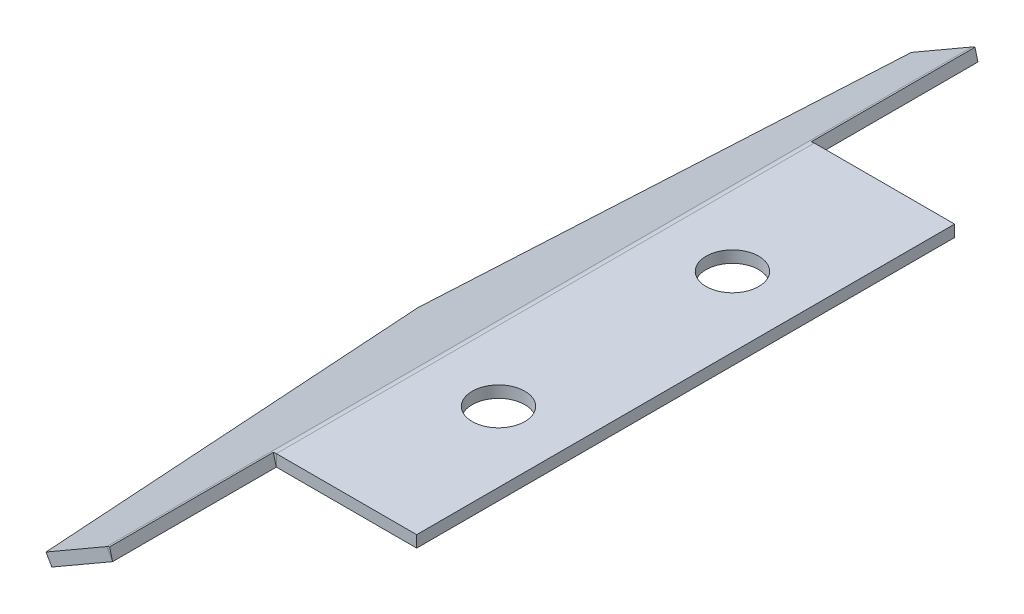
ISO-10303-21;
HEADER;
FILE_DESCRIPTION(('STEP AP214'),'2;1');
FILE_NAME('part.step','',(''),(''),'','','');
FILE_SCHEMA(('AUTOMOTIVE_DESIGN { 1 0 10303 214 1 1 1 1 }'));
ENDSEC;
DATA;
#1=APPLICATION_CONTEXT('core data for automotive mechanical design processes');
#2=APPLICATION_PROTOCOL_DEFINITION('international standard','automotive_design',2000,#1);
#3=PRODUCT_CONTEXT('',#1,'mechanical');
#4=PRODUCT('Part','Part','',(#3));
#5=PRODUCT_RELATED_PRODUCT_CATEGORY('part','',(#4));
#6=PRODUCT_DEFINITION_FORMATION('','',#4);
#7=PRODUCT_DEFINITION_CONTEXT('part definition',#1,'design');
#8=PRODUCT_DEFINITION('design','',#6,#7);
#9=PRODUCT_DEFINITION_SHAPE('','',#8);
#10=(LENGTH_UNIT() NAMED_UNIT(*) SI_UNIT(.MILLI.,.METRE.));
#11=(NAMED_UNIT(*) PLANE_ANGLE_UNIT() SI_UNIT($,.RADIAN.));
#12=(NAMED_UNIT(*) SI_UNIT($,.STERADIAN.) SOLID_ANGLE_UNIT());
#13=UNCERTAINTY_MEASURE_WITH_UNIT(LENGTH_MEASURE(1.E-05),#10,'distance_accuracy_value','');
#14=(GEOMETRIC_REPRESENTATION_CONTEXT(3) GLOBAL_UNCERTAINTY_ASSIGNED_CONTEXT((#13)) GLOBAL_UNIT_ASSIGNED_CONTEXT((#10,
#11,#12)) REPRESENTATION_CONTEXT('',''));
#15=CARTESIAN_POINT('',(0.,0.,0.));
#16=DIRECTION('',(0.,0.,1.));
#17=DIRECTION('',(1.,0.,0.));
#18=AXIS2_PLACEMENT_3D('',#15,#16,#17);
#19=CARTESIAN_POINT('',(-4.08846385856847,-8.13397636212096,-37.));
#20=DIRECTION('',(-0.500000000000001,0.866025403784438,0.));
#21=DIRECTION('',(0.,0.,1.));
#22=AXIS2_PLACEMENT_3D('',#19,#20,#21);
#23=PLANE('',#22);
#24=DIRECTION('',(0.866025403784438,0.500000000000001,0.));
#25=VECTOR('',#24,1.);
#26=CARTESIAN_POINT('',(11.4999934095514,0.866023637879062,37.));
#27=LINE('',#26,#25);
#28=CARTESIAN_POINT('',(6.30384098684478,-2.13397636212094,37.));
#29=VERTEX_POINT('',#28);
#30=CARTESIAN_POINT('',(11.4997644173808,0.865891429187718,37.));
#31=VERTEX_POINT('',#30);
#32=EDGE_CURVE('E45',#29,#31,#27,.T.);
#33=ORIENTED_EDGE('',*,*,#32,.T.);
#34=DIRECTION('',(0.,0.,-1.));
#35=VECTOR('',#34,1.);
#36=CARTESIAN_POINT('',(11.4997644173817,0.865891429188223,-37.));
#37=LINE('',#36,#35);
#38=CARTESIAN_POINT('',(11.4997644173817,0.865891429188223,-37.));
#39=VERTEX_POINT('',#38);
#40=EDGE_CURVE('E147',#31,#39,#37,.T.);
#41=ORIENTED_EDGE('',*,*,#40,.T.);
#42=DIRECTION('',(-0.866025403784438,-0.500000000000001,0.));
#43=VECTOR('',#42,1.);
#44=CARTESIAN_POINT('',(11.4999934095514,0.866023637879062,-37.));
#45=LINE('',#44,#43);
#46=CARTESIAN_POINT('',(6.30384098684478,-2.13397636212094,-37.));
#47=VERTEX_POINT('',#46);
#48=EDGE_CURVE('E168',#39,#47,#45,.T.);
#49=ORIENTED_EDGE('',*,*,#48,.T.);
#50=DIRECTION('',(-0.138625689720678,-0.0800355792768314,0.987105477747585));
#51=VECTOR('',#50,1.);
#52=CARTESIAN_POINT('',(6.30384098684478,-2.13397636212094,-37.));
#53=LINE('',#52,#51);
#54=CARTESIAN_POINT('',(1.10768856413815,-5.13397636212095,0.));
#55=VERTEX_POINT('',#54);
#56=EDGE_CURVE('E66',#47,#55,#53,.T.);
#57=ORIENTED_EDGE('',*,*,#56,.T.);
#58=DIRECTION('',(0.138625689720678,0.0800355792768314,0.987105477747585));
#59=VECTOR('',#58,1.);
#60=CARTESIAN_POINT('',(6.30384098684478,-2.13397636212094,37.));
#61=LINE('',#60,#59);
#62=EDGE_CURVE('E166',#55,#29,#61,.T.);
#63=ORIENTED_EDGE('',*,*,#62,.T.);
#64=EDGE_LOOP('',(#33,#41,#49,#57,#63));
#65=FACE_BOUND('',#64,.T.);
#66=ADVANCED_FACE('F41',(#65),#23,.T.);
#67=CARTESIAN_POINT('',(-3.58846385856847,-9.00000176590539,-37.));
#68=DIRECTION('',(-0.500000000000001,0.866025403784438,0.));
#69=DIRECTION('',(0.,0.,1.));
#70=AXIS2_PLACEMENT_3D('',#67,#68,#69);
#71=PLANE('',#70);
#72=DIRECTION('',(0.,0.,-1.));
#73=VECTOR('',#72,1.);
#74=CARTESIAN_POINT('',(11.9997644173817,-0.000133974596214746,-37.));
#75=LINE('',#74,#73);
#76=CARTESIAN_POINT('',(11.9997644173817,-0.000133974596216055,37.));
#77=VERTEX_POINT('',#76);
#78=CARTESIAN_POINT('',(11.9997644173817,-0.000133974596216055,-37.));
#79=VERTEX_POINT('',#78);
#80=EDGE_CURVE('E50',#77,#79,#75,.T.);
#81=ORIENTED_EDGE('',*,*,#80,.F.);
#82=DIRECTION('',(0.866025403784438,0.500000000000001,0.));
#83=VECTOR('',#82,1.);
#84=CARTESIAN_POINT('',(11.9999934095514,-1.76590537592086E-06,37.));
#85=LINE('',#84,#83);
#86=CARTESIAN_POINT('',(6.80384098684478,-3.00000176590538,37.));
#87=VERTEX_POINT('',#86);
#88=EDGE_CURVE('E171',#87,#77,#85,.T.);
#89=ORIENTED_EDGE('',*,*,#88,.F.);
#90=DIRECTION('',(0.138625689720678,0.0800355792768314,0.987105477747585));
#91=VECTOR('',#90,1.);
#92=CARTESIAN_POINT('',(6.80384098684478,-3.00000176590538,37.));
#93=LINE('',#92,#91);
#94=CARTESIAN_POINT('',(1.60768856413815,-6.00000176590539,0.));
#95=VERTEX_POINT('',#94);
#96=EDGE_CURVE('E179',#95,#87,#93,.T.);
#97=ORIENTED_EDGE('',*,*,#96,.F.);
#98=DIRECTION('',(-0.138625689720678,-0.0800355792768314,0.987105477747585));
#99=VECTOR('',#98,1.);
#100=CARTESIAN_POINT('',(6.80384098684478,-3.00000176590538,-37.));
#101=LINE('',#100,#99);
#102=CARTESIAN_POINT('',(6.80384098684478,-3.00000176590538,-37.));
#103=VERTEX_POINT('',#102);
#104=EDGE_CURVE('E83',#103,#95,#101,.T.);
#105=ORIENTED_EDGE('',*,*,#104,.F.);
#106=DIRECTION('',(-0.866025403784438,-0.500000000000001,0.));
#107=VECTOR('',#106,1.);
#108=CARTESIAN_POINT('',(11.9999934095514,-1.76590537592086E-06,-37.));
#109=LINE('',#108,#107);
#110=EDGE_CURVE('E177',#79,#103,#109,.T.);
#111=ORIENTED_EDGE('',*,*,#110,.F.);
#112=EDGE_LOOP('',(#81,#89,#97,#105,#111));
#113=FACE_BOUND('',#112,.T.);
#114=ADVANCED_FACE('F196',(#113),#71,.F.);
#115=CARTESIAN_POINT('',(6.30384098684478,-2.13397636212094,37.));
#116=DIRECTION('',(0.854858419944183,0.493552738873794,-0.160071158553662));
#117=DIRECTION('',(-0.138625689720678,-0.0800355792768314,-0.987105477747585));
#118=AXIS2_PLACEMENT_3D('',#115,#116,#117);
#119=PLANE('',#118);
#120=ORIENTED_EDGE('',*,*,#96,.T.);
#121=DIRECTION('',(0.500000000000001,-0.866025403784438,0.));
#122=VECTOR('',#121,1.);
#123=CARTESIAN_POINT('',(6.30384098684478,-2.13397636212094,37.));
#124=LINE('',#123,#122);
#125=EDGE_CURVE('E155',#29,#87,#124,.T.);
#126=ORIENTED_EDGE('',*,*,#125,.F.);
#127=ORIENTED_EDGE('',*,*,#62,.F.);
#128=DIRECTION('',(0.500000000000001,-0.866025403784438,0.));
#129=VECTOR('',#128,1.);
#130=CARTESIAN_POINT('',(1.10768856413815,-5.13397636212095,0.));
#131=LINE('',#130,#129);
#132=EDGE_CURVE('E181',#55,#95,#131,.T.);
#133=ORIENTED_EDGE('',*,*,#132,.T.);
#134=EDGE_LOOP('',(#120,#126,#127,#133));
#135=FACE_BOUND('',#134,.T.);
#136=ADVANCED_FACE('F194',(#135),#119,.F.);
#137=CARTESIAN_POINT('',(11.4999934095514,0.866023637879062,37.));
#138=DIRECTION('',(0.,0.,-1.));
#139=DIRECTION('',(-0.866025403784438,-0.500000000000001,0.));
#140=AXIS2_PLACEMENT_3D('',#137,#138,#139);
#141=PLANE('',#140);
#142=DIRECTION('',(0.500000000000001,-0.866025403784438,0.));
#143=VECTOR('',#142,1.);
#144=CARTESIAN_POINT('',(11.4997644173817,0.865891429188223,37.));
#145=LINE('',#144,#143);
#146=EDGE_CURVE('E154',#31,#77,#145,.T.);
#147=ORIENTED_EDGE('',*,*,#146,.F.);
#148=ORIENTED_EDGE('',*,*,#32,.F.);
#149=ORIENTED_EDGE('',*,*,#125,.T.);
#150=ORIENTED_EDGE('',*,*,#88,.T.);
#151=EDGE_LOOP('',(#147,#148,#149,#150));
#152=FACE_BOUND('',#151,.T.);
#153=ADVANCED_FACE('F170',(#152),#141,.F.);
#154=CARTESIAN_POINT('',(11.4999934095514,0.866023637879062,-37.));
#155=DIRECTION('',(0.,0.,1.));
#156=DIRECTION('',(0.866025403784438,0.500000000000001,0.));
#157=AXIS2_PLACEMENT_3D('',#154,#155,#156);
#158=PLANE('',#157);
#159=DIRECTION('',(-0.500000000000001,0.866025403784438,0.));
#160=VECTOR('',#159,1.);
#161=CARTESIAN_POINT('',(11.4997644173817,0.865891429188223,-37.));
#162=LINE('',#161,#160);
#163=EDGE_CURVE('E12',#79,#39,#162,.T.);
#164=ORIENTED_EDGE('',*,*,#163,.F.);
#165=ORIENTED_EDGE('',*,*,#110,.T.);
#166=DIRECTION('',(0.500000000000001,-0.866025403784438,0.));
#167=VECTOR('',#166,1.);
#168=CARTESIAN_POINT('',(6.30384098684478,-2.13397636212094,-37.));
#169=LINE('',#168,#167);
#170=EDGE_CURVE('E183',#47,#103,#169,.T.);
#171=ORIENTED_EDGE('',*,*,#170,.F.);
#172=ORIENTED_EDGE('',*,*,#48,.F.);
#173=EDGE_LOOP('',(#164,#165,#171,#172));
#174=FACE_BOUND('',#173,.T.);
#175=ADVANCED_FACE('F43',(#174),#158,.F.);
#176=CARTESIAN_POINT('',(6.30384098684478,-2.13397636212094,-37.));
#177=DIRECTION('',(0.854858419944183,0.493552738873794,0.160071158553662));
#178=DIRECTION('',(0.138625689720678,0.0800355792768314,-0.987105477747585));
#179=AXIS2_PLACEMENT_3D('',#176,#177,#178);
#180=PLANE('',#179);
#181=ORIENTED_EDGE('',*,*,#104,.T.);
#182=ORIENTED_EDGE('',*,*,#132,.F.);
#183=ORIENTED_EDGE('',*,*,#56,.F.);
#184=ORIENTED_EDGE('',*,*,#170,.T.);
#185=EDGE_LOOP('',(#181,#182,#183,#184));
#186=FACE_BOUND('',#185,.T.);
#187=ADVANCED_FACE('F331',(#186),#180,.F.);
#188=CARTESIAN_POINT('',(18.,1.,10.));
#189=DIRECTION('',(0.,-1.,0.));
#190=DIRECTION('',(0.,0.,-1.));
#191=AXIS2_PLACEMENT_3D('',#188,#189,#190);
#192=CYLINDRICAL_SURFACE('',#191,2.25);
#193=CARTESIAN_POINT('',(18.,1.,10.));
#194=DIRECTION('',(0.,1.,0.));
#195=DIRECTION('',(0.,0.,-1.));
#196=AXIS2_PLACEMENT_3D('',#193,#194,#195);
#197=CIRCLE('',#196,2.25);
#198=CARTESIAN_POINT('',(18.,1.,7.75));
#199=VERTEX_POINT('',#198);
#200=EDGE_CURVE('E261',#199,#199,#197,.T.);
#201=ORIENTED_EDGE('',*,*,#200,.T.);
#202=EDGE_LOOP('',(#201));
#203=FACE_BOUND('',#202,.T.);
#204=CARTESIAN_POINT('',(18.,0.,10.));
#205=DIRECTION('',(0.,1.,0.));
#206=DIRECTION('',(0.,0.,-1.));
#207=AXIS2_PLACEMENT_3D('',#204,#205,#206);
#208=CIRCLE('',#207,2.25);
#209=CARTESIAN_POINT('',(18.,0.,7.75));
#210=VERTEX_POINT('',#209);
#211=EDGE_CURVE('E238',#210,#210,#208,.T.);
#212=ORIENTED_EDGE('',*,*,#211,.F.);
#213=EDGE_LOOP('',(#212));
#214=FACE_BOUND('',#213,.T.);
#215=ADVANCED_FACE('F401',(#203,#214),#192,.F.);
#216=CARTESIAN_POINT('',(18.,1.,-10.));
#217=DIRECTION('',(0.,-1.,0.));
#218=DIRECTION('',(0.,0.,-1.));
#219=AXIS2_PLACEMENT_3D('',#216,#217,#218);
#220=CYLINDRICAL_SURFACE('',#219,2.25);
#221=CARTESIAN_POINT('',(18.,1.,-10.));
#222=DIRECTION('',(0.,1.,0.));
#223=DIRECTION('',(0.,0.,1.));
#224=AXIS2_PLACEMENT_3D('',#221,#222,#223);
#225=CIRCLE('',#224,2.25);
#226=CARTESIAN_POINT('',(18.,1.,-7.75));
#227=VERTEX_POINT('',#226);
#228=EDGE_CURVE('E258',#227,#227,#225,.T.);
#229=ORIENTED_EDGE('',*,*,#228,.T.);
#230=EDGE_LOOP('',(#229));
#231=FACE_BOUND('',#230,.T.);
#232=CARTESIAN_POINT('',(18.,0.,-10.));
#233=DIRECTION('',(0.,1.,0.));
#234=DIRECTION('',(0.,0.,1.));
#235=AXIS2_PLACEMENT_3D('',#232,#233,#234);
#236=CIRCLE('',#235,2.25);
#237=CARTESIAN_POINT('',(18.,0.,-7.75));
#238=VERTEX_POINT('',#237);
#239=EDGE_CURVE('E235',#238,#238,#236,.T.);
#240=ORIENTED_EDGE('',*,*,#239,.F.);
#241=EDGE_LOOP('',(#240));
#242=FACE_BOUND('',#241,.T.);
#243=ADVANCED_FACE('F390',(#231,#242),#220,.F.);
#244=CARTESIAN_POINT('',(24.,1.,23.));
#245=DIRECTION('',(-1.,0.,0.));
#246=DIRECTION('',(0.,0.,1.));
#247=AXIS2_PLACEMENT_3D('',#244,#245,#246);
#248=PLANE('',#247);
#249=DIRECTION('',(0.,0.,-1.));
#250=VECTOR('',#249,1.);
#251=CARTESIAN_POINT('',(24.,0.,23.));
#252=LINE('',#251,#250);
#253=CARTESIAN_POINT('',(24.,0.,23.));
#254=VERTEX_POINT('',#253);
#255=CARTESIAN_POINT('',(24.,0.,-23.));
#256=VERTEX_POINT('',#255);
#257=EDGE_CURVE('E256',#254,#256,#252,.T.);
#258=ORIENTED_EDGE('',*,*,#257,.T.);
#259=DIRECTION('',(0.,-1.,0.));
#260=VECTOR('',#259,1.);
#261=CARTESIAN_POINT('',(24.,1.,-23.));
#262=LINE('',#261,#260);
#263=CARTESIAN_POINT('',(24.,1.,-23.));
#264=VERTEX_POINT('',#263);
#265=EDGE_CURVE('E190',#264,#256,#262,.T.);
#266=ORIENTED_EDGE('',*,*,#265,.F.);
#267=DIRECTION('',(0.,0.,-1.));
#268=VECTOR('',#267,1.);
#269=CARTESIAN_POINT('',(24.,1.,23.));
#270=LINE('',#269,#268);
#271=CARTESIAN_POINT('',(24.,1.,23.));
#272=VERTEX_POINT('',#271);
#273=EDGE_CURVE('E249',#272,#264,#270,.T.);
#274=ORIENTED_EDGE('',*,*,#273,.F.);
#275=DIRECTION('',(0.,-1.,0.));
#276=VECTOR('',#275,1.);
#277=CARTESIAN_POINT('',(24.,1.,23.));
#278=LINE('',#277,#276);
#279=EDGE_CURVE('E253',#272,#254,#278,.T.);
#280=ORIENTED_EDGE('',*,*,#279,.T.);
#281=EDGE_LOOP('',(#258,#266,#274,#280));
#282=FACE_BOUND('',#281,.T.);
#283=ADVANCED_FACE('F380',(#282),#248,.F.);
#284=CARTESIAN_POINT('',(-6.,1.,-37.));
#285=DIRECTION('',(0.,1.,0.));
#286=DIRECTION('',(0.,0.,1.));
#287=AXIS2_PLACEMENT_3D('',#284,#285,#286);
#288=PLANE('',#287);
#289=DIRECTION('',(0.,0.,-1.));
#290=VECTOR('',#289,1.);
#291=CARTESIAN_POINT('',(12.0002644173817,1.,-37.));
#292=LINE('',#291,#290);
#293=CARTESIAN_POINT('',(12.0002644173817,1.,23.));
#294=VERTEX_POINT('',#293);
#295=CARTESIAN_POINT('',(12.0002644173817,1.,-23.));
#296=VERTEX_POINT('',#295);
#297=EDGE_CURVE('E222',#294,#296,#292,.T.);
#298=ORIENTED_EDGE('',*,*,#297,.F.);
#299=DIRECTION('',(1.,0.,0.));
#300=VECTOR('',#299,1.);
#301=CARTESIAN_POINT('',(24.,1.,23.));
#302=LINE('',#301,#300);
#303=EDGE_CURVE('E251',#294,#272,#302,.T.);
#304=ORIENTED_EDGE('',*,*,#303,.T.);
#305=ORIENTED_EDGE('',*,*,#273,.T.);
#306=DIRECTION('',(-1.,0.,0.));
#307=VECTOR('',#306,1.);
#308=CARTESIAN_POINT('',(24.,1.,-23.));
#309=LINE('',#308,#307);
#310=EDGE_CURVE('E246',#264,#296,#309,.T.);
#311=ORIENTED_EDGE('',*,*,#310,.T.);
#312=EDGE_LOOP('',(#298,#304,#305,#311));
#313=FACE_BOUND('',#312,.T.);
#314=ORIENTED_EDGE('',*,*,#228,.F.);
#315=EDGE_LOOP('',(#314));
#316=FACE_BOUND('',#315,.T.);
#317=ORIENTED_EDGE('',*,*,#200,.F.);
#318=EDGE_LOOP('',(#317));
#319=FACE_BOUND('',#318,.T.);
#320=ADVANCED_FACE('F280',(#313,#316,#319),#288,.T.);
#321=CARTESIAN_POINT('',(24.,1.,23.));
#322=DIRECTION('',(0.,0.,-1.));
#323=DIRECTION('',(-1.,0.,0.));
#324=AXIS2_PLACEMENT_3D('',#321,#322,#323);
#325=PLANE('',#324);
#326=ORIENTED_EDGE('',*,*,#303,.F.);
#327=DIRECTION('',(0.,-1.,0.));
#328=VECTOR('',#327,1.);
#329=CARTESIAN_POINT('',(12.0002644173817,1.,23.));
#330=LINE('',#329,#328);
#331=CARTESIAN_POINT('',(12.0002644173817,0.,23.));
#332=VERTEX_POINT('',#331);
#333=EDGE_CURVE('E243',#294,#332,#330,.T.);
#334=ORIENTED_EDGE('',*,*,#333,.T.);
#335=DIRECTION('',(1.,0.,0.));
#336=VECTOR('',#335,1.);
#337=CARTESIAN_POINT('',(24.,0.,23.));
#338=LINE('',#337,#336);
#339=EDGE_CURVE('E241',#332,#254,#338,.T.);
#340=ORIENTED_EDGE('',*,*,#339,.T.);
#341=ORIENTED_EDGE('',*,*,#279,.F.);
#342=EDGE_LOOP('',(#326,#334,#340,#341));
#343=FACE_BOUND('',#342,.T.);
#344=ADVANCED_FACE('F364',(#343),#325,.F.);
#345=CARTESIAN_POINT('',(-6.,0.,-37.));
#346=DIRECTION('',(0.,1.,0.));
#347=DIRECTION('',(0.,0.,1.));
#348=AXIS2_PLACEMENT_3D('',#345,#346,#347);
#349=PLANE('',#348);
#350=ORIENTED_EDGE('',*,*,#211,.T.);
#351=EDGE_LOOP('',(#350));
#352=FACE_BOUND('',#351,.T.);
#353=ORIENTED_EDGE('',*,*,#239,.T.);
#354=EDGE_LOOP('',(#353));
#355=FACE_BOUND('',#354,.T.);
#356=ORIENTED_EDGE('',*,*,#339,.F.);
#357=DIRECTION('',(0.,0.,-1.));
#358=VECTOR('',#357,1.);
#359=CARTESIAN_POINT('',(12.0002644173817,0.,-37.));
#360=LINE('',#359,#358);
#361=CARTESIAN_POINT('',(12.0002644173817,0.,-23.));
#362=VERTEX_POINT('',#361);
#363=EDGE_CURVE('E232',#332,#362,#360,.T.);
#364=ORIENTED_EDGE('',*,*,#363,.T.);
#365=DIRECTION('',(-1.,0.,0.));
#366=VECTOR('',#365,1.);
#367=CARTESIAN_POINT('',(24.,0.,-23.));
#368=LINE('',#367,#366);
#369=EDGE_CURVE('E229',#256,#362,#368,.T.);
#370=ORIENTED_EDGE('',*,*,#369,.F.);
#371=ORIENTED_EDGE('',*,*,#257,.F.);
#372=EDGE_LOOP('',(#356,#364,#370,#371));
#373=FACE_BOUND('',#372,.T.);
#374=ADVANCED_FACE('F291',(#352,#355,#373),#349,.F.);
#375=CARTESIAN_POINT('',(24.,1.,-23.));
#376=DIRECTION('',(0.,0.,1.));
#377=DIRECTION('',(1.,0.,0.));
#378=AXIS2_PLACEMENT_3D('',#375,#376,#377);
#379=PLANE('',#378);
#380=ORIENTED_EDGE('',*,*,#369,.T.);
#381=DIRECTION('',(0.,1.,0.));
#382=VECTOR('',#381,1.);
#383=CARTESIAN_POINT('',(12.0002644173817,1.,-23.));
#384=LINE('',#383,#382);
#385=EDGE_CURVE('E226',#362,#296,#384,.T.);
#386=ORIENTED_EDGE('',*,*,#385,.T.);
#387=ORIENTED_EDGE('',*,*,#310,.F.);
#388=ORIENTED_EDGE('',*,*,#265,.T.);
#389=EDGE_LOOP('',(#380,#386,#387,#388));
#390=FACE_BOUND('',#389,.T.);
#391=ADVANCED_FACE('F285',(#390),#379,.F.);
#392=CARTESIAN_POINT('',(12.0002644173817,-0.000999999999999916,37.));
#393=DIRECTION('',(0.,0.,1.));
#394=DIRECTION('',(1.,0.,0.));
#395=AXIS2_PLACEMENT_3D('',#392,#393,#394);
#396=PLANE('',#395);
#397=ORIENTED_EDGE('',*,*,#146,.T.);
#398=CARTESIAN_POINT('',(12.0002644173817,-0.000999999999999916,37.));
#399=DIRECTION('',(0.,0.,1.));
#400=DIRECTION('',(1.,0.,0.));
#401=AXIS2_PLACEMENT_3D('',#398,#399,#400);
#402=CIRCLE('',#401,0.000999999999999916);
#403=CARTESIAN_POINT('',(12.0000055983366,-3.40741737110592E-05,37.));
#404=VERTEX_POINT('',#403);
#405=EDGE_CURVE('E205',#77,#404,#402,.F.);
#406=ORIENTED_EDGE('',*,*,#405,.T.);
#407=DIRECTION('',(-0.258819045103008,0.965925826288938,0.));
#408=VECTOR('',#407,1.);
#409=CARTESIAN_POINT('',(11.7411865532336,0.965891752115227,37.));
#410=LINE('',#409,#408);
#411=CARTESIAN_POINT('',(11.7411865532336,0.965891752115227,37.));
#412=VERTEX_POINT('',#411);
#413=EDGE_CURVE('E161',#404,#412,#410,.T.);
#414=ORIENTED_EDGE('',*,*,#413,.T.);
#415=CARTESIAN_POINT('',(12.0002644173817,-0.000999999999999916,37.));
#416=DIRECTION('',(0.,0.,-1.));
#417=DIRECTION('',(-1.,0.,0.));
#418=AXIS2_PLACEMENT_3D('',#415,#416,#417);
#419=CIRCLE('',#418,1.001);
#420=EDGE_CURVE('E151',#31,#412,#419,.T.);
#421=ORIENTED_EDGE('',*,*,#420,.F.);
#422=EDGE_LOOP('',(#397,#406,#414,#421));
#423=FACE_BOUND('',#422,.T.);
#424=ADVANCED_FACE('F158',(#423),#396,.T.);
#425=CARTESIAN_POINT('',(11.7411865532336,0.965891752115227,30.));
#426=DIRECTION('',(0.965925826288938,0.258819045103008,0.));
#427=DIRECTION('',(0.,0.,-1.));
#428=AXIS2_PLACEMENT_3D('',#425,#426,#427);
#429=PLANE('',#428);
#430=ORIENTED_EDGE('',*,*,#413,.F.);
#431=DIRECTION('',(0.,0.,1.));
#432=VECTOR('',#431,1.);
#433=CARTESIAN_POINT('',(12.0000055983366,-3.40741737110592E-05,-74.006756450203));
#434=LINE('',#433,#432);
#435=CARTESIAN_POINT('',(12.0000055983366,-3.40741737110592E-05,23.));
#436=VERTEX_POINT('',#435);
#437=EDGE_CURVE('E296',#404,#436,#434,.F.);
#438=ORIENTED_EDGE('',*,*,#437,.T.);
#439=DIRECTION('',(-0.258819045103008,0.965925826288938,0.));
#440=VECTOR('',#439,1.);
#441=CARTESIAN_POINT('',(11.7411865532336,0.965891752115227,23.));
#442=LINE('',#441,#440);
#443=CARTESIAN_POINT('',(11.7411865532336,0.965891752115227,23.));
#444=VERTEX_POINT('',#443);
#445=EDGE_CURVE('E219',#436,#444,#442,.T.);
#446=ORIENTED_EDGE('',*,*,#445,.T.);
#447=DIRECTION('',(0.,0.,-1.));
#448=VECTOR('',#447,1.);
#449=CARTESIAN_POINT('',(11.7411865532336,0.965891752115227,37.));
#450=LINE('',#449,#448);
#451=EDGE_CURVE('E162',#412,#444,#450,.T.);
#452=ORIENTED_EDGE('',*,*,#451,.F.);
#453=EDGE_LOOP('',(#430,#438,#446,#452));
#454=FACE_BOUND('',#453,.T.);
#455=ADVANCED_FACE('F300',(#454),#429,.T.);
#456=CARTESIAN_POINT('',(12.0002644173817,-0.000999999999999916,23.));
#457=DIRECTION('',(0.,0.,1.));
#458=DIRECTION('',(1.,0.,0.));
#459=AXIS2_PLACEMENT_3D('',#456,#457,#458);
#460=PLANE('',#459);
#461=ORIENTED_EDGE('',*,*,#445,.F.);
#462=CARTESIAN_POINT('',(12.0002644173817,-0.000999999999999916,23.));
#463=DIRECTION('',(0.,0.,1.));
#464=DIRECTION('',(1.,0.,0.));
#465=AXIS2_PLACEMENT_3D('',#462,#463,#464);
#466=CIRCLE('',#465,0.000999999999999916);
#467=EDGE_CURVE('E293',#436,#332,#466,.F.);
#468=ORIENTED_EDGE('',*,*,#467,.T.);
#469=ORIENTED_EDGE('',*,*,#333,.F.);
#470=CARTESIAN_POINT('',(12.0002644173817,-0.000999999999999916,23.));
#471=DIRECTION('',(0.,0.,-1.));
#472=DIRECTION('',(-1.,0.,0.));
#473=AXIS2_PLACEMENT_3D('',#470,#471,#472);
#474=CIRCLE('',#473,1.001);
#475=EDGE_CURVE('E270',#444,#294,#474,.T.);
#476=ORIENTED_EDGE('',*,*,#475,.F.);
#477=EDGE_LOOP('',(#461,#468,#469,#476));
#478=FACE_BOUND('',#477,.T.);
#479=ADVANCED_FACE('F313',(#478),#460,.T.);
#480=CARTESIAN_POINT('',(12.0002644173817,-0.000999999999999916,-23.));
#481=DIRECTION('',(0.,0.,-1.));
#482=DIRECTION('',(-1.,0.,0.));
#483=AXIS2_PLACEMENT_3D('',#480,#481,#482);
#484=PLANE('',#483);
#485=ORIENTED_EDGE('',*,*,#385,.F.);
#486=CARTESIAN_POINT('',(12.0002644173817,-0.000999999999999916,-23.));
#487=DIRECTION('',(0.,0.,1.));
#488=DIRECTION('',(1.,0.,0.));
#489=AXIS2_PLACEMENT_3D('',#486,#487,#488);
#490=CIRCLE('',#489,0.000999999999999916);
#491=CARTESIAN_POINT('',(12.0000055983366,-3.40741737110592E-05,-23.));
#492=VERTEX_POINT('',#491);
#493=EDGE_CURVE('E212',#362,#492,#490,.T.);
#494=ORIENTED_EDGE('',*,*,#493,.T.);
#495=DIRECTION('',(-0.258819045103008,0.965925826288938,0.));
#496=VECTOR('',#495,1.);
#497=CARTESIAN_POINT('',(11.7411865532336,0.965891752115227,-23.));
#498=LINE('',#497,#496);
#499=CARTESIAN_POINT('',(11.7411865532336,0.965891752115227,-23.));
#500=VERTEX_POINT('',#499);
#501=EDGE_CURVE('E217',#492,#500,#498,.T.);
#502=ORIENTED_EDGE('',*,*,#501,.T.);
#503=CARTESIAN_POINT('',(12.0002644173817,-0.000999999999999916,-23.));
#504=DIRECTION('',(0.,0.,1.));
#505=DIRECTION('',(1.,0.,0.));
#506=AXIS2_PLACEMENT_3D('',#503,#504,#505);
#507=CIRCLE('',#506,1.001);
#508=EDGE_CURVE('E267',#296,#500,#507,.T.);
#509=ORIENTED_EDGE('',*,*,#508,.F.);
#510=EDGE_LOOP('',(#485,#494,#502,#509));
#511=FACE_BOUND('',#510,.T.);
#512=ADVANCED_FACE('F274',(#511),#484,.T.);
#513=CARTESIAN_POINT('',(11.7411865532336,0.965891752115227,-30.));
#514=DIRECTION('',(0.965925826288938,0.258819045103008,0.));
#515=DIRECTION('',(0.,0.,-1.));
#516=AXIS2_PLACEMENT_3D('',#513,#514,#515);
#517=PLANE('',#516);
#518=ORIENTED_EDGE('',*,*,#501,.F.);
#519=DIRECTION('',(0.,0.,1.));
#520=VECTOR('',#519,1.);
#521=CARTESIAN_POINT('',(12.0000055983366,-3.40741737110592E-05,-74.006756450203));
#522=LINE('',#521,#520);
#523=CARTESIAN_POINT('',(12.0000055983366,-3.40741737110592E-05,-37.));
#524=VERTEX_POINT('',#523);
#525=EDGE_CURVE('E210',#492,#524,#522,.F.);
#526=ORIENTED_EDGE('',*,*,#525,.T.);
#527=DIRECTION('',(-0.258819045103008,0.965925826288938,0.));
#528=VECTOR('',#527,1.);
#529=CARTESIAN_POINT('',(11.7411865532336,0.965891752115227,-37.));
#530=LINE('',#529,#528);
#531=CARTESIAN_POINT('',(11.7411865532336,0.965891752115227,-37.));
#532=VERTEX_POINT('',#531);
#533=EDGE_CURVE('E208',#524,#532,#530,.T.);
#534=ORIENTED_EDGE('',*,*,#533,.T.);
#535=DIRECTION('',(0.,0.,-1.));
#536=VECTOR('',#535,1.);
#537=CARTESIAN_POINT('',(11.7411865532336,0.965891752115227,-23.));
#538=LINE('',#537,#536);
#539=EDGE_CURVE('E277',#500,#532,#538,.T.);
#540=ORIENTED_EDGE('',*,*,#539,.F.);
#541=EDGE_LOOP('',(#518,#526,#534,#540));
#542=FACE_BOUND('',#541,.T.);
#543=ADVANCED_FACE('F305',(#542),#517,.T.);
#544=CARTESIAN_POINT('',(12.0002644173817,-0.000999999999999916,-37.));
#545=DIRECTION('',(0.,0.,-1.));
#546=DIRECTION('',(-1.,0.,0.));
#547=AXIS2_PLACEMENT_3D('',#544,#545,#546);
#548=PLANE('',#547);
#549=CARTESIAN_POINT('',(12.0002644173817,-0.000999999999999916,-37.));
#550=DIRECTION('',(0.,0.,1.));
#551=DIRECTION('',(1.,0.,0.));
#552=AXIS2_PLACEMENT_3D('',#549,#550,#551);
#553=CIRCLE('',#552,0.000999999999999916);
#554=EDGE_CURVE('E163',#524,#79,#553,.T.);
#555=ORIENTED_EDGE('',*,*,#554,.T.);
#556=ORIENTED_EDGE('',*,*,#163,.T.);
#557=CARTESIAN_POINT('',(12.0002644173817,-0.000999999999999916,-37.));
#558=DIRECTION('',(0.,0.,1.));
#559=DIRECTION('',(1.,0.,0.));
#560=AXIS2_PLACEMENT_3D('',#557,#558,#559);
#561=CIRCLE('',#560,1.001);
#562=EDGE_CURVE('E58',#532,#39,#561,.T.);
#563=ORIENTED_EDGE('',*,*,#562,.F.);
#564=ORIENTED_EDGE('',*,*,#533,.F.);
#565=EDGE_LOOP('',(#555,#556,#563,#564));
#566=FACE_BOUND('',#565,.T.);
#567=ADVANCED_FACE('F207',(#566),#548,.T.);
#568=CARTESIAN_POINT('',(12.0002644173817,-0.000999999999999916,-74.006756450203));
#569=DIRECTION('',(0.,0.,1.));
#570=DIRECTION('',(1.,0.,0.));
#571=AXIS2_PLACEMENT_3D('',#568,#569,#570);
#572=CYLINDRICAL_SURFACE('',#571,1.001);
#573=ORIENTED_EDGE('',*,*,#539,.T.);
#574=ORIENTED_EDGE('',*,*,#562,.T.);
#575=ORIENTED_EDGE('',*,*,#40,.F.);
#576=ORIENTED_EDGE('',*,*,#420,.T.);
#577=ORIENTED_EDGE('',*,*,#451,.T.);
#578=ORIENTED_EDGE('',*,*,#475,.T.);
#579=ORIENTED_EDGE('',*,*,#297,.T.);
#580=ORIENTED_EDGE('',*,*,#508,.T.);
#581=EDGE_LOOP('',(#573,#574,#575,#576,#577,#578,#579,#580));
#582=FACE_BOUND('',#581,.T.);
#583=ADVANCED_FACE('F149',(#582),#572,.T.);
#584=CARTESIAN_POINT('',(12.0002644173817,-0.000999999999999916,-74.006756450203));
#585=DIRECTION('',(0.,0.,1.));
#586=DIRECTION('',(1.,0.,0.));
#587=AXIS2_PLACEMENT_3D('',#584,#585,#586);
#588=CYLINDRICAL_SURFACE('',#587,0.000999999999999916);
#589=ORIENTED_EDGE('',*,*,#525,.F.);
#590=ORIENTED_EDGE('',*,*,#493,.F.);
#591=ORIENTED_EDGE('',*,*,#363,.F.);
#592=ORIENTED_EDGE('',*,*,#467,.F.);
#593=ORIENTED_EDGE('',*,*,#437,.F.);
#594=ORIENTED_EDGE('',*,*,#405,.F.);
#595=ORIENTED_EDGE('',*,*,#80,.T.);
#596=ORIENTED_EDGE('',*,*,#554,.F.);
#597=EDGE_LOOP('',(#589,#590,#591,#592,#593,#594,#595,#596));
#598=FACE_BOUND('',#597,.T.);
#599=ADVANCED_FACE('F203',(#598),#588,.F.);
#600=CLOSED_SHELL('',(#66,#114,#136,#153,#175,#187,#215,#243,#283,#320,#344,#374,#391,#424,#455,
#479,#512,#543,#567,#583,#599));
#601=MANIFOLD_SOLID_BREP('B2',#600);
#602=ADVANCED_BREP_SHAPE_REPRESENTATION('',(#18,#601),#14);
#603=SHAPE_DEFINITION_REPRESENTATION(#9,#602);
ENDSEC;
END-ISO-10303-21;
